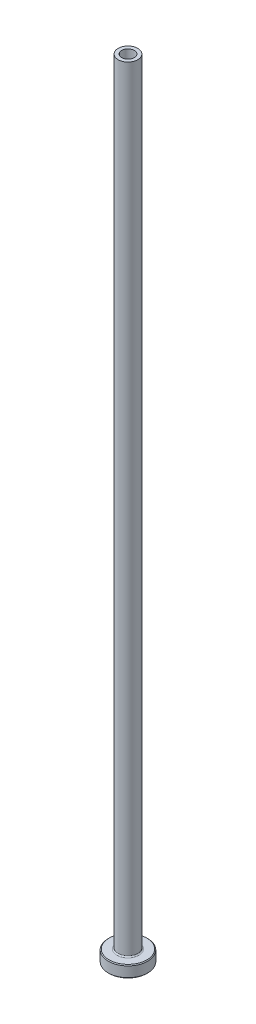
ISO-10303-21;
HEADER;
FILE_DESCRIPTION(('STEP AP214'),'2;1');
FILE_NAME('part.step','',(''),(''),'','','');
FILE_SCHEMA(('AUTOMOTIVE_DESIGN { 1 0 10303 214 1 1 1 1 }'));
ENDSEC;
DATA;
#1=APPLICATION_CONTEXT('core data for automotive mechanical design processes');
#2=APPLICATION_PROTOCOL_DEFINITION('international standard','automotive_design',2000,#1);
#3=PRODUCT_CONTEXT('',#1,'mechanical');
#4=PRODUCT('Part','Part','',(#3));
#5=PRODUCT_RELATED_PRODUCT_CATEGORY('part','',(#4));
#6=PRODUCT_DEFINITION_FORMATION('','',#4);
#7=PRODUCT_DEFINITION_CONTEXT('part definition',#1,'design');
#8=PRODUCT_DEFINITION('design','',#6,#7);
#9=PRODUCT_DEFINITION_SHAPE('','',#8);
#10=(LENGTH_UNIT() NAMED_UNIT(*) SI_UNIT(.MILLI.,.METRE.));
#11=(NAMED_UNIT(*) PLANE_ANGLE_UNIT() SI_UNIT($,.RADIAN.));
#12=(NAMED_UNIT(*) SI_UNIT($,.STERADIAN.) SOLID_ANGLE_UNIT());
#13=UNCERTAINTY_MEASURE_WITH_UNIT(LENGTH_MEASURE(1.E-05),#10,'distance_accuracy_value','');
#14=(GEOMETRIC_REPRESENTATION_CONTEXT(3) GLOBAL_UNCERTAINTY_ASSIGNED_CONTEXT((#13)) GLOBAL_UNIT_ASSIGNED_CONTEXT((#10,
#11,#12)) REPRESENTATION_CONTEXT('',''));
#15=CARTESIAN_POINT('',(0.,0.,0.));
#16=DIRECTION('',(0.,0.,1.));
#17=DIRECTION('',(1.,0.,0.));
#18=AXIS2_PLACEMENT_3D('',#15,#16,#17);
#19=CARTESIAN_POINT('',(0.,92.1876809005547,0.));
#20=DIRECTION('',(0.,1.,0.));
#21=DIRECTION('',(0.,0.,1.));
#22=AXIS2_PLACEMENT_3D('',#19,#20,#21);
#23=CYLINDRICAL_SURFACE('',#22,1.6);
#24=CARTESIAN_POINT('',(0.,200.,0.));
#25=DIRECTION('',(0.,1.,0.));
#26=DIRECTION('',(0.,0.,1.));
#27=AXIS2_PLACEMENT_3D('',#24,#25,#26);
#28=CIRCLE('',#27,1.6);
#29=CARTESIAN_POINT('',(0.,200.,1.6));
#30=VERTEX_POINT('',#29);
#31=EDGE_CURVE('E62',#30,#30,#28,.T.);
#32=ORIENTED_EDGE('',*,*,#31,.T.);
#33=EDGE_LOOP('',(#32));
#34=FACE_BOUND('',#33,.T.);
#35=CARTESIAN_POINT('',(0.,155.,0.));
#36=DIRECTION('',(0.,1.,0.));
#37=DIRECTION('',(0.,0.,1.));
#38=AXIS2_PLACEMENT_3D('',#35,#36,#37);
#39=CIRCLE('',#38,1.6);
#40=CARTESIAN_POINT('',(0.,155.,1.6));
#41=VERTEX_POINT('',#40);
#42=EDGE_CURVE('E71',#41,#41,#39,.T.);
#43=ORIENTED_EDGE('',*,*,#42,.F.);
#44=EDGE_LOOP('',(#43));
#45=FACE_BOUND('',#44,.T.);
#46=ADVANCED_FACE('F30',(#34,#45),#23,.F.);
#47=CARTESIAN_POINT('',(-1.6,200.,0.));
#48=DIRECTION('',(0.,1.,0.));
#49=DIRECTION('',(0.,0.,1.));
#50=AXIS2_PLACEMENT_3D('',#47,#48,#49);
#51=PLANE('',#50);
#52=CARTESIAN_POINT('',(0.,200.,0.));
#53=DIRECTION('',(0.,1.,0.));
#54=DIRECTION('',(0.,0.,1.));
#55=AXIS2_PLACEMENT_3D('',#52,#53,#54);
#56=CIRCLE('',#55,2.50000000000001);
#57=CARTESIAN_POINT('',(0.,200.,2.50000000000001));
#58=VERTEX_POINT('',#57);
#59=EDGE_CURVE('E65',#58,#58,#56,.T.);
#60=ORIENTED_EDGE('',*,*,#59,.T.);
#61=EDGE_LOOP('',(#60));
#62=FACE_BOUND('',#61,.T.);
#63=ORIENTED_EDGE('',*,*,#31,.F.);
#64=EDGE_LOOP('',(#63));
#65=FACE_BOUND('',#64,.T.);
#66=ADVANCED_FACE('F79',(#62,#65),#51,.T.);
#67=CARTESIAN_POINT('',(0.,92.1876809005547,0.));
#68=DIRECTION('',(0.,1.,0.));
#69=DIRECTION('',(0.,0.,1.));
#70=AXIS2_PLACEMENT_3D('',#67,#68,#69);
#71=CYLINDRICAL_SURFACE('',#70,2.5);
#72=CARTESIAN_POINT('',(0.,3.3,0.));
#73=DIRECTION('',(0.,1.,0.));
#74=DIRECTION('',(0.,0.,1.));
#75=AXIS2_PLACEMENT_3D('',#72,#73,#74);
#76=CIRCLE('',#75,2.5);
#77=CARTESIAN_POINT('',(0.,3.3,2.5));
#78=VERTEX_POINT('',#77);
#79=EDGE_CURVE('E59',#78,#78,#76,.T.);
#80=ORIENTED_EDGE('',*,*,#79,.T.);
#81=EDGE_LOOP('',(#80));
#82=FACE_BOUND('',#81,.T.);
#83=ORIENTED_EDGE('',*,*,#59,.F.);
#84=EDGE_LOOP('',(#83));
#85=FACE_BOUND('',#84,.T.);
#86=ADVANCED_FACE('F85',(#82,#85),#71,.T.);
#87=CARTESIAN_POINT('',(-2.49999999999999,3.,0.));
#88=DIRECTION('',(0.,1.,0.));
#89=DIRECTION('',(0.,0.,1.));
#90=AXIS2_PLACEMENT_3D('',#87,#88,#89);
#91=PLANE('',#90);
#92=CARTESIAN_POINT('',(0.,3.,0.));
#93=DIRECTION('',(0.,1.,0.));
#94=DIRECTION('',(0.,0.,1.));
#95=AXIS2_PLACEMENT_3D('',#92,#93,#94);
#96=CIRCLE('',#95,4.79999999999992);
#97=CARTESIAN_POINT('',(0.,3.,4.79999999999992));
#98=VERTEX_POINT('',#97);
#99=EDGE_CURVE('E53',#98,#98,#96,.T.);
#100=ORIENTED_EDGE('',*,*,#99,.T.);
#101=EDGE_LOOP('',(#100));
#102=FACE_BOUND('',#101,.T.);
#103=CARTESIAN_POINT('',(0.,3.,0.));
#104=DIRECTION('',(0.,1.,0.));
#105=DIRECTION('',(0.,0.,1.));
#106=AXIS2_PLACEMENT_3D('',#103,#104,#105);
#107=CIRCLE('',#106,2.8);
#108=CARTESIAN_POINT('',(0.,3.,2.8));
#109=VERTEX_POINT('',#108);
#110=EDGE_CURVE('E56',#109,#109,#107,.F.);
#111=ORIENTED_EDGE('',*,*,#110,.T.);
#112=EDGE_LOOP('',(#111));
#113=FACE_BOUND('',#112,.T.);
#114=ADVANCED_FACE('F111',(#102,#113),#91,.T.);
#115=CARTESIAN_POINT('',(0.,92.1876809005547,0.));
#116=DIRECTION('',(0.,1.,0.));
#117=DIRECTION('',(0.,0.,1.));
#118=AXIS2_PLACEMENT_3D('',#115,#116,#117);
#119=CYLINDRICAL_SURFACE('',#118,4.99999999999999);
#120=CARTESIAN_POINT('',(0.,2.79999999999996,0.));
#121=DIRECTION('',(0.,1.,0.));
#122=DIRECTION('',(0.,0.,1.));
#123=AXIS2_PLACEMENT_3D('',#120,#121,#122);
#124=CIRCLE('',#123,4.99999999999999);
#125=CARTESIAN_POINT('',(0.,2.79999999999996,4.99999999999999));
#126=VERTEX_POINT('',#125);
#127=EDGE_CURVE('E45',#126,#126,#124,.F.);
#128=ORIENTED_EDGE('',*,*,#127,.T.);
#129=EDGE_LOOP('',(#128));
#130=FACE_BOUND('',#129,.T.);
#131=CARTESIAN_POINT('',(0.,0.199999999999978,0.));
#132=DIRECTION('',(0.,-1.,0.));
#133=DIRECTION('',(0.,0.,-1.));
#134=AXIS2_PLACEMENT_3D('',#131,#132,#133);
#135=CIRCLE('',#134,4.99999999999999);
#136=CARTESIAN_POINT('',(0.,0.199999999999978,4.99999999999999));
#137=VERTEX_POINT('',#136);
#138=EDGE_CURVE('E50',#137,#137,#135,.F.);
#139=ORIENTED_EDGE('',*,*,#138,.T.);
#140=EDGE_LOOP('',(#139));
#141=FACE_BOUND('',#140,.T.);
#142=ADVANCED_FACE('F108',(#130,#141),#119,.T.);
#143=CARTESIAN_POINT('',(-4.99999999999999,0.,0.));
#144=DIRECTION('',(0.,-1.,0.));
#145=DIRECTION('',(0.,0.,-1.));
#146=AXIS2_PLACEMENT_3D('',#143,#144,#145);
#147=PLANE('',#146);
#148=CARTESIAN_POINT('',(0.,0.,0.));
#149=DIRECTION('',(0.,-1.,0.));
#150=DIRECTION('',(0.,0.,-1.));
#151=AXIS2_PLACEMENT_3D('',#148,#149,#150);
#152=CIRCLE('',#151,2.35000000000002);
#153=CARTESIAN_POINT('',(0.,0.,-2.35000000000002));
#154=VERTEX_POINT('',#153);
#155=EDGE_CURVE('E37',#154,#154,#152,.F.);
#156=ORIENTED_EDGE('',*,*,#155,.T.);
#157=EDGE_LOOP('',(#156));
#158=FACE_BOUND('',#157,.T.);
#159=CARTESIAN_POINT('',(0.,0.,0.));
#160=DIRECTION('',(0.,-1.,0.));
#161=DIRECTION('',(0.,0.,-1.));
#162=AXIS2_PLACEMENT_3D('',#159,#160,#161);
#163=CIRCLE('',#162,4.80000000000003);
#164=CARTESIAN_POINT('',(0.,0.,4.80000000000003));
#165=VERTEX_POINT('',#164);
#166=EDGE_CURVE('E41',#165,#165,#163,.T.);
#167=ORIENTED_EDGE('',*,*,#166,.T.);
#168=EDGE_LOOP('',(#167));
#169=FACE_BOUND('',#168,.T.);
#170=ADVANCED_FACE('F110',(#158,#169),#147,.T.);
#171=CARTESIAN_POINT('',(0.,92.1876809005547,0.));
#172=DIRECTION('',(0.,1.,0.));
#173=DIRECTION('',(0.,0.,1.));
#174=AXIS2_PLACEMENT_3D('',#171,#172,#173);
#175=CYLINDRICAL_SURFACE('',#174,1.85);
#176=CARTESIAN_POINT('',(0.,0.500000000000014,0.));
#177=DIRECTION('',(0.,-1.,0.));
#178=DIRECTION('',(0.,0.,-1.));
#179=AXIS2_PLACEMENT_3D('',#176,#177,#178);
#180=CIRCLE('',#179,1.85);
#181=CARTESIAN_POINT('',(0.,0.500000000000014,-1.85));
#182=VERTEX_POINT('',#181);
#183=EDGE_CURVE('E10',#182,#182,#180,.T.);
#184=ORIENTED_EDGE('',*,*,#183,.T.);
#185=EDGE_LOOP('',(#184));
#186=FACE_BOUND('',#185,.T.);
#187=CARTESIAN_POINT('',(0.,143.,0.));
#188=DIRECTION('',(0.,1.,0.));
#189=DIRECTION('',(0.,0.,1.));
#190=AXIS2_PLACEMENT_3D('',#187,#188,#189);
#191=CIRCLE('',#190,1.85000000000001);
#192=CARTESIAN_POINT('',(0.,143.,1.85000000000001));
#193=VERTEX_POINT('',#192);
#194=EDGE_CURVE('E68',#193,#193,#191,.T.);
#195=ORIENTED_EDGE('',*,*,#194,.T.);
#196=EDGE_LOOP('',(#195));
#197=FACE_BOUND('',#196,.T.);
#198=ADVANCED_FACE('F118',(#186,#197),#175,.F.);
#199=CARTESIAN_POINT('',(0.,143.,0.));
#200=DIRECTION('',(0.,-1.,0.));
#201=DIRECTION('',(0.,0.,-1.));
#202=AXIS2_PLACEMENT_3D('',#199,#200,#201);
#203=CONICAL_SURFACE('',#202,1.85000000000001,0.0208303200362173);
#204=ORIENTED_EDGE('',*,*,#42,.T.);
#205=EDGE_LOOP('',(#204));
#206=FACE_BOUND('',#205,.T.);
#207=ORIENTED_EDGE('',*,*,#194,.F.);
#208=EDGE_LOOP('',(#207));
#209=FACE_BOUND('',#208,.T.);
#210=ADVANCED_FACE('F75',(#206,#209),#203,.F.);
#211=CARTESIAN_POINT('',(0.,3.3,0.));
#212=DIRECTION('',(0.,1.,0.));
#213=DIRECTION('',(0.,0.,1.));
#214=AXIS2_PLACEMENT_3D('',#211,#212,#213);
#215=TOROIDAL_SURFACE('',#214,2.8,0.3);
#216=ORIENTED_EDGE('',*,*,#110,.F.);
#217=EDGE_LOOP('',(#216));
#218=FACE_BOUND('',#217,.T.);
#219=ORIENTED_EDGE('',*,*,#79,.F.);
#220=EDGE_LOOP('',(#219));
#221=FACE_BOUND('',#220,.T.);
#222=ADVANCED_FACE('F90',(#218,#221),#215,.F.);
#223=CARTESIAN_POINT('',(0.,3.,0.));
#224=DIRECTION('',(0.,-1.,0.));
#225=DIRECTION('',(0.,0.,-1.));
#226=AXIS2_PLACEMENT_3D('',#223,#224,#225);
#227=CONICAL_SURFACE('',#226,4.79999999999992,0.785398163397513);
#228=ORIENTED_EDGE('',*,*,#127,.F.);
#229=EDGE_LOOP('',(#228));
#230=FACE_BOUND('',#229,.T.);
#231=ORIENTED_EDGE('',*,*,#99,.F.);
#232=EDGE_LOOP('',(#231));
#233=FACE_BOUND('',#232,.T.);
#234=ADVANCED_FACE('F93',(#230,#233),#227,.T.);
#235=CARTESIAN_POINT('',(0.,0.199999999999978,0.));
#236=DIRECTION('',(0.,1.,0.));
#237=DIRECTION('',(0.,0.,1.));
#238=AXIS2_PLACEMENT_3D('',#235,#236,#237);
#239=CONICAL_SURFACE('',#238,4.99999999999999,0.785398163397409);
#240=CARTESIAN_POINT('',(0.,0.,4.80000000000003));
#241=CARTESIAN_POINT('',(0.,0.00208333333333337,4.80208333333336));
#242=CARTESIAN_POINT('',(0.,0.00416666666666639,4.80416666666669));
#243=CARTESIAN_POINT('',(0.,0.00833333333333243,4.80833333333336));
#244=CARTESIAN_POINT('',(0.,0.0104166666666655,4.81041666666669));
#245=CARTESIAN_POINT('',(0.,0.0145833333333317,4.81458333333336));
#246=CARTESIAN_POINT('',(0.,0.0166666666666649,4.81666666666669));
#247=CARTESIAN_POINT('',(0.,0.0208333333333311,4.82083333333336));
#248=CARTESIAN_POINT('',(0.,0.0229166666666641,4.82291666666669));
#249=CARTESIAN_POINT('',(0.,0.0270833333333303,4.82708333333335));
#250=CARTESIAN_POINT('',(0.,0.0291666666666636,4.82916666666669));
#251=CARTESIAN_POINT('',(0.,0.0333333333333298,4.83333333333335));
#252=CARTESIAN_POINT('',(0.,0.0354166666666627,4.83541666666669));
#253=CARTESIAN_POINT('',(0.,0.0395833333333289,4.83958333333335));
#254=CARTESIAN_POINT('',(0.,0.0416666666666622,4.84166666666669));
#255=CARTESIAN_POINT('',(0.,0.0458333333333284,4.84583333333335));
#256=CARTESIAN_POINT('',(0.,0.0479166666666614,4.84791666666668));
#257=CARTESIAN_POINT('',(0.,0.0520833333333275,4.85208333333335));
#258=CARTESIAN_POINT('',(0.,0.0541666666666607,4.85416666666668));
#259=CARTESIAN_POINT('',(0.,0.058333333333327,4.85833333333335));
#260=CARTESIAN_POINT('',(0.,0.0604166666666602,4.86041666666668));
#261=CARTESIAN_POINT('',(0.,0.0645833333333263,4.86458333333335));
#262=CARTESIAN_POINT('',(0.,0.0666666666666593,4.86666666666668));
#263=CARTESIAN_POINT('',(0.,0.0708333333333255,4.87083333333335));
#264=CARTESIAN_POINT('',(0.,0.0729166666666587,4.87291666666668));
#265=CARTESIAN_POINT('',(0.,0.0770833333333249,4.87708333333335));
#266=CARTESIAN_POINT('',(0.,0.0791666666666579,4.87916666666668));
#267=CARTESIAN_POINT('',(0.,0.0833333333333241,4.88333333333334));
#268=CARTESIAN_POINT('',(0.,0.0854166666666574,4.88541666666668));
#269=CARTESIAN_POINT('',(0.,0.0895833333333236,4.88958333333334));
#270=CARTESIAN_POINT('',(0.,0.0916666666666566,4.89166666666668));
#271=CARTESIAN_POINT('',(0.,0.0958333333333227,4.89583333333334));
#272=CARTESIAN_POINT('',(0.,0.0979166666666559,4.89791666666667));
#273=CARTESIAN_POINT('',(0.,0.102083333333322,4.90208333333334));
#274=CARTESIAN_POINT('',(0.,0.104166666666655,4.90416666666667));
#275=CARTESIAN_POINT('',(0.,0.108333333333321,4.90833333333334));
#276=CARTESIAN_POINT('',(0.,0.110416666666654,4.91041666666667));
#277=CARTESIAN_POINT('',(0.,0.114583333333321,4.91458333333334));
#278=CARTESIAN_POINT('',(0.,0.116666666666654,4.91666666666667));
#279=CARTESIAN_POINT('',(0.,0.12083333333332,4.92083333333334));
#280=CARTESIAN_POINT('',(0.,0.122916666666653,4.92291666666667));
#281=CARTESIAN_POINT('',(0.,0.127083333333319,4.92708333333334));
#282=CARTESIAN_POINT('',(0.,0.129166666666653,4.92916666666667));
#283=CARTESIAN_POINT('',(0.,0.133333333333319,4.93333333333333));
#284=CARTESIAN_POINT('',(0.,0.135416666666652,4.93541666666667));
#285=CARTESIAN_POINT('',(0.,0.139583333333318,4.93958333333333));
#286=CARTESIAN_POINT('',(0.,0.141666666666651,4.94166666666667));
#287=CARTESIAN_POINT('',(0.,0.145833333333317,4.94583333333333));
#288=CARTESIAN_POINT('',(0.,0.14791666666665,4.94791666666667));
#289=CARTESIAN_POINT('',(0.,0.152083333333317,4.95208333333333));
#290=CARTESIAN_POINT('',(0.,0.15416666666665,4.95416666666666));
#291=CARTESIAN_POINT('',(0.,0.158333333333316,4.95833333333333));
#292=CARTESIAN_POINT('',(0.,0.160416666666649,4.96041666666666));
#293=CARTESIAN_POINT('',(0.,0.164583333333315,4.96458333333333));
#294=CARTESIAN_POINT('',(0.,0.166666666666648,4.96666666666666));
#295=CARTESIAN_POINT('',(0.,0.170833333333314,4.97083333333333));
#296=CARTESIAN_POINT('',(0.,0.172916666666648,4.97291666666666));
#297=CARTESIAN_POINT('',(0.,0.177083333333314,4.97708333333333));
#298=CARTESIAN_POINT('',(0.,0.179166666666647,4.97916666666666));
#299=CARTESIAN_POINT('',(0.,0.183333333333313,4.98333333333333));
#300=CARTESIAN_POINT('',(0.,0.185416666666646,4.98541666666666));
#301=CARTESIAN_POINT('',(0.,0.189583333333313,4.98958333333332));
#302=CARTESIAN_POINT('',(0.,0.191666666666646,4.99166666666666));
#303=CARTESIAN_POINT('',(0.,0.195833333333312,4.99583333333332));
#304=CARTESIAN_POINT('',(0.,0.197916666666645,4.99791666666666));
#305=CARTESIAN_POINT('',(0.,0.199999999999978,4.99999999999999));
#306=B_SPLINE_CURVE_WITH_KNOTS('',3,(#240,#241,#242,#243,#244,#245,#246,#247,#248,#249,#250,
#251,#252,#253,#254,#255,#256,#257,#258,#259,#260,#261,#262,#263,#264,#265,#266,#267,#268,#269,
#270,#271,#272,#273,#274,#275,#276,#277,#278,#279,#280,#281,#282,#283,#284,#285,#286,#287,#288,
#289,#290,#291,#292,#293,#294,#295,#296,#297,#298,#299,#300,#301,#302,#303,#304,#305),
.UNSPECIFIED.,.F.,.F.,(4,2,2,2,2,2,2,2,2,2,2,2,2,2,2,2,2,2,2,2,2,2,2,2,2,2,2,2,2,2,2,2,4),(0.,
0.00883883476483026,0.0176776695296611,0.0265165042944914,0.0353553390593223,0.0441941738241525,
0.0530330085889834,0.0618718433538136,0.0707106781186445,0.0795495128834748,0.088388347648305,
0.0972271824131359,0.106066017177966,0.114904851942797,0.123743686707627,0.132582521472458,
0.141421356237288,0.150260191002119,0.15909902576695,0.16793786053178,0.176776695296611,
0.185615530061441,0.194454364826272,0.203293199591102,0.212132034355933,0.220970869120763,
0.229809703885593,0.238648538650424,0.247487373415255,0.256326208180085,0.265165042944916,
0.274003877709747,0.282842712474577),.UNSPECIFIED.);
#307=EDGE_CURVE('BSEAM96',#165,#137,#306,.T.);
#308=ORIENTED_EDGE('',*,*,#166,.F.);
#309=ORIENTED_EDGE('',*,*,#138,.F.);
#310=ORIENTED_EDGE('',*,*,#307,.T.);
#311=ORIENTED_EDGE('',*,*,#307,.F.);
#312=EDGE_LOOP('',(#308,#310,#309,#311));
#313=FACE_BOUND('',#312,.T.);
#314=ADVANCED_FACE('F96',(#313),#239,.T.);
#315=CARTESIAN_POINT('',(0.,0.,0.));
#316=DIRECTION('',(0.,-1.,0.));
#317=DIRECTION('',(0.,0.,-1.));
#318=AXIS2_PLACEMENT_3D('',#315,#316,#317);
#319=CONICAL_SURFACE('',#318,2.35000000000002,0.785398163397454);
#320=ORIENTED_EDGE('',*,*,#183,.F.);
#321=EDGE_LOOP('',(#320));
#322=FACE_BOUND('',#321,.T.);
#323=ORIENTED_EDGE('',*,*,#155,.F.);
#324=EDGE_LOOP('',(#323));
#325=FACE_BOUND('',#324,.T.);
#326=ADVANCED_FACE('F32',(#322,#325),#319,.F.);
#327=CLOSED_SHELL('',(#46,#66,#86,#114,#142,#170,#198,#210,#222,#234,#314,#326));
#328=MANIFOLD_SOLID_BREP('B2',#327);
#329=ADVANCED_BREP_SHAPE_REPRESENTATION('',(#18,#328),#14);
#330=SHAPE_DEFINITION_REPRESENTATION(#9,#329);
ENDSEC;
END-ISO-10303-21;
